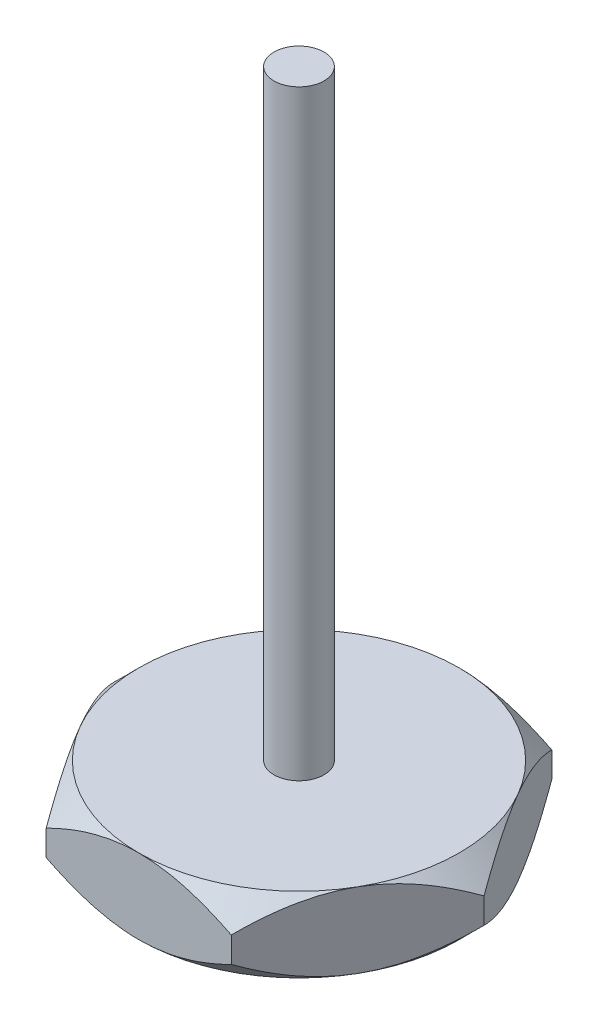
from build123d import *

# Parameters (mm, degrees)
BOSS_EXTRUDE1_DEPTH     = 1.875
SKETCH2_OUTSIDE_W       = 32.922
SKETCH2_OUTSIDE_H       = 30.446
SKETCH2_OUTSIDE_R       = 8
CUT_EXTRUDE1_DEPTH      = 3.75
CUT_EXTRUDE1_DRAFT      = -45
MIRROR1_COPY_1_SKETCH_W = 32.922
MIRROR1_COPY_1_SKETCH_H = 30.446
MIRROR1_COPY_1_SKETCH_R = 8
MIRROR1_COPY_1_DEPTH    = 3.75
MIRROR1_COPY_1_DRAFT    = -45
SKETCH3_R               = 1.25
BOSS_EXTRUDE2_DEPTH     = 30


with BuildPart() as part:
    # Sketch1 → Boss-Extrude1 (new, symmetric)
    with BuildSketch(Plane(origin=(0, 0, 0), x_dir=(1, 0, 0), z_dir=(0, 1, 0))):
        Polygon((-4.618802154, 8), (-9.237604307, 0), (-4.618802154, -8), (4.618802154, -8), (9.237604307, 0), (4.618802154, 8), align=None)
    extrude(amount=BOSS_EXTRUDE1_DEPTH, both=True)


with BuildPart() as cut_extrude1_tool:
    # Sketch2 outside → Cut-Extrude1 (with draft: the straight prism first)
    with BuildSketch(Plane(origin=(0, 1.875, 0), x_dir=(1, 0, 0), z_dir=(0, 1, 0))):
        Rectangle(SKETCH2_OUTSIDE_W, SKETCH2_OUTSIDE_H)
        Circle(SKETCH2_OUTSIDE_R, mode=Mode.SUBTRACT)
    extrude(amount=-CUT_EXTRUDE1_DEPTH)
    # Cut-Extrude1: the draft: its side faces are tilted about the plane it starts from
    cut_extrude1_sides = [cut_extrude1_tool.faces().sort_by_distance(p)[0] for p in [
        (0, 0, 15.223),
        (16.461, 0, 0),
        (0, 0, -15.223),
        (-16.461, 0, 0),
        (-8, 0, 0),
    ]]
    draft(cut_extrude1_sides, Plane(origin=(0, 1.875, 0), x_dir=(1, 0, 0), z_dir=(0, 1, 0)), CUT_EXTRUDE1_DRAFT)


with BuildPart() as part_1:
    add(part.part)

    # Cut-Extrude1: cut by cut_extrude1_tool
    add(cut_extrude1_tool.part, mode=Mode.SUBTRACT)


with BuildPart() as mirror1_copy_1_tool:
    # Mirror1 copy 1 sketch → Mirror1 copy 1 (with draft: the straight prism first)
    with BuildSketch(Plane.XZ.offset(1.875)):
        Rectangle(MIRROR1_COPY_1_SKETCH_W, MIRROR1_COPY_1_SKETCH_H)
        Circle(MIRROR1_COPY_1_SKETCH_R, mode=Mode.SUBTRACT)
    extrude(amount=-MIRROR1_COPY_1_DEPTH)
    # Mirror1 copy 1: the draft: its side faces are tilted about the plane it starts from
    mirror1_copy_1_sides = [mirror1_copy_1_tool.faces().sort_by_distance(p)[0] for p in [
        (0, 0, 15.223),
        (16.461, 0, 0),
        (0, 0, -15.223),
        (-16.461, 0, 0),
        (-8, 0, 0),
    ]]
    draft(mirror1_copy_1_sides, Plane.XZ.offset(1.875), MIRROR1_COPY_1_DRAFT)


with BuildPart() as part_2:
    add(part_1.part)

    # Mirror1 copy 1: cut by mirror1_copy_1_tool
    add(mirror1_copy_1_tool.part, mode=Mode.SUBTRACT)

    # Sketch3 → Boss-Extrude2 (add)
    with BuildSketch(Plane(origin=(0, 1.875, 0), x_dir=(1, 0, 0), z_dir=(0, 1, 0))):
        with Locations(Location((0, 0, 0), (0, 0, 270))):
            Circle(SKETCH3_R)
    extrude(amount=BOSS_EXTRUDE2_DEPTH)


solid = part_2.part
